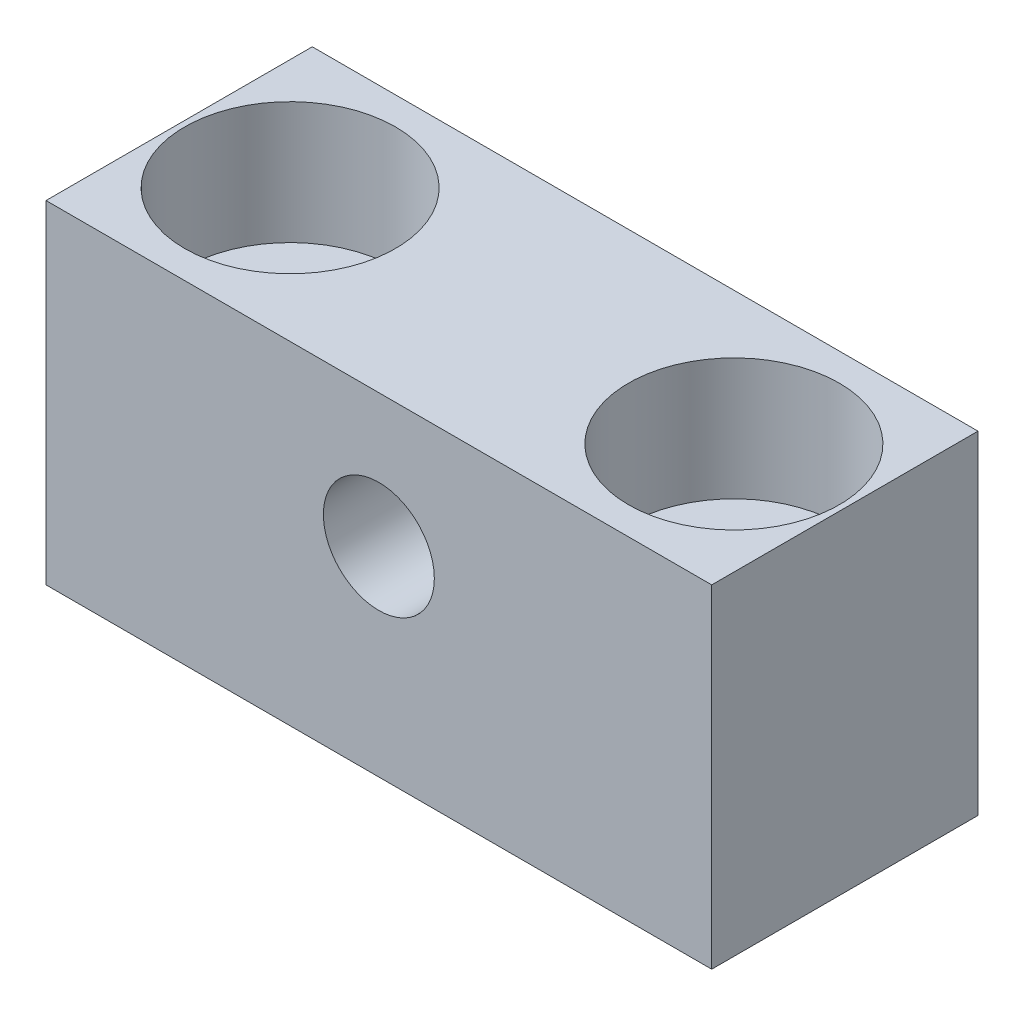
from build123d import *

# Parameters (mm, degrees)
SKETCH_1_W          = 30
SKETCH_1_H          = 15
SKETCH_1_R          = 2.5
EXTRUDE_1_DEPTH     = 12
CUT_EXTRUDE_1_REACH = 37.623
SKETCH_2_R          = 2.75
SKETCH_3_R          = 4.75
CUT_EXTRUDE_2_DEPTH = 5.5


with BuildPart() as part:
    # Sketch 1 → Extrude 1 (new body)
    with BuildSketch(Plane.XY):
        with Locations((15, 7.5)):
            Rectangle(SKETCH_1_W, SKETCH_1_H)
        with Locations((15, 9)):
            Circle(SKETCH_1_R, mode=Mode.SUBTRACT)
    extrude(amount=EXTRUDE_1_DEPTH)

    # Sketch 2 → Cut-Extrude 1 (cut, up to next)
    with BuildSketch(Plane(origin=(0, 15, 0), x_dir=(1, 0, 0), z_dir=(0, 1, 0)), mode=Mode.PRIVATE) as cut_extrude_1_sk1:
        with Locations(Location((25, -6, 0), (0, 0, 270))):
            Circle(SKETCH_2_R)
    cut_extrude_1_tool1 = extrude(cut_extrude_1_sk1.sketch, amount=-CUT_EXTRUDE_1_REACH, mode=Mode.PRIVATE) & part.part
    # Sketch 2 → Cut-Extrude 1 (cut, up to next)
    with BuildSketch(Plane(origin=(0, 15, 0), x_dir=(1, 0, 0), z_dir=(0, 1, 0)), mode=Mode.PRIVATE) as cut_extrude_1_sk2:
        with Locations(Location((5, -6, 0), (0, 0, 270))):
            Circle(SKETCH_2_R)
    cut_extrude_1_tool2 = extrude(cut_extrude_1_sk2.sketch, amount=-CUT_EXTRUDE_1_REACH, mode=Mode.PRIVATE) & part.part
    add(cut_extrude_1_tool1.solids().sort_by_distance((25, 15, 6))[0], mode=Mode.SUBTRACT)
    add(cut_extrude_1_tool2.solids().sort_by_distance((5, 15, 6))[0], mode=Mode.SUBTRACT)

    # Sketch 3 → Cut-Extrude 2 (cut)
    with BuildSketch(Plane(origin=(0, 15, 0), x_dir=(1, 0, 0), z_dir=(0, 1, 0))):
        with Locations(Location((25, -6, 0), (0, 0, 270))):
            Circle(SKETCH_3_R)
        with Locations(Location((5, -6, 0), (0, 0, 270))):
            Circle(SKETCH_3_R)
    extrude(amount=-CUT_EXTRUDE_2_DEPTH, mode=Mode.SUBTRACT)


solid = part.part
